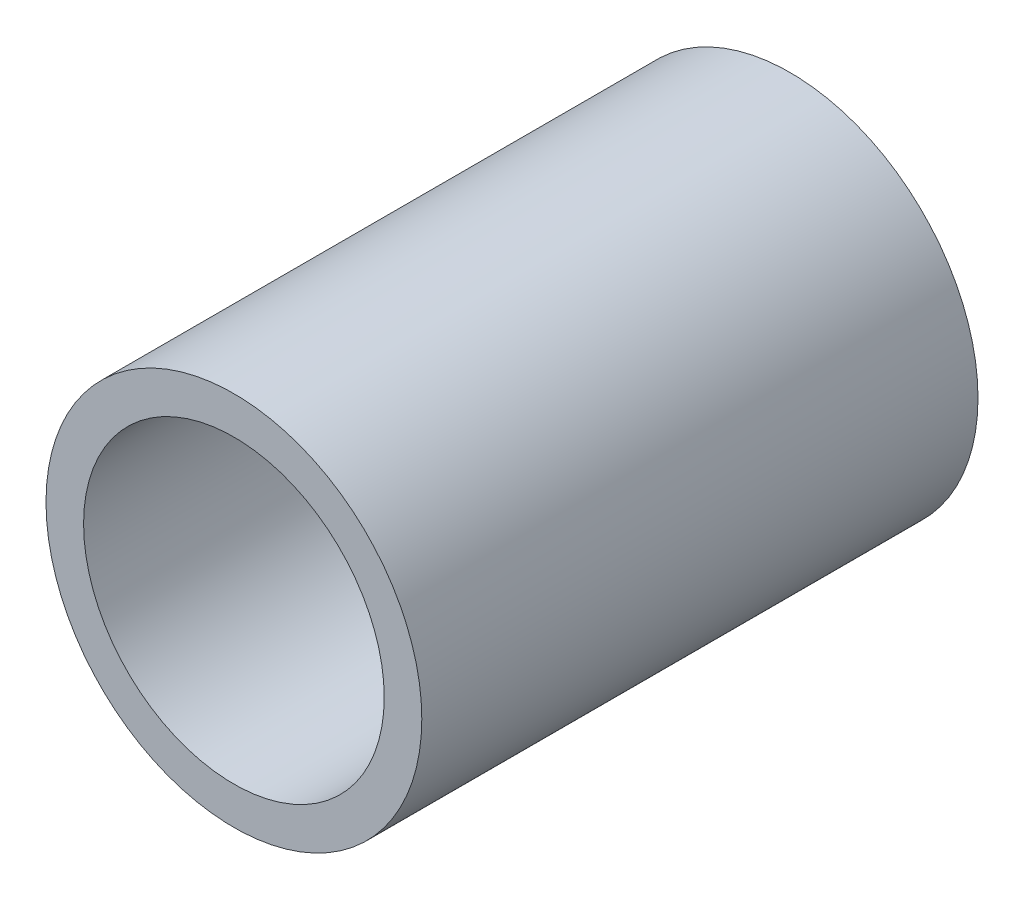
from build123d import *

# Parameters (mm, degrees)
ESQUISSE1_R      = 12.5
ESQUISSE1_R_2    = 10
EXTRUSION1_DEPTH = 37


with BuildPart() as part:
    # Esquisse1 → Extrusion1 (new body)
    with BuildSketch(Plane.XY):
        Circle(ESQUISSE1_R)
        Circle(ESQUISSE1_R_2, mode=Mode.SUBTRACT)
    extrude(amount=EXTRUSION1_DEPTH)


solid = part.part
